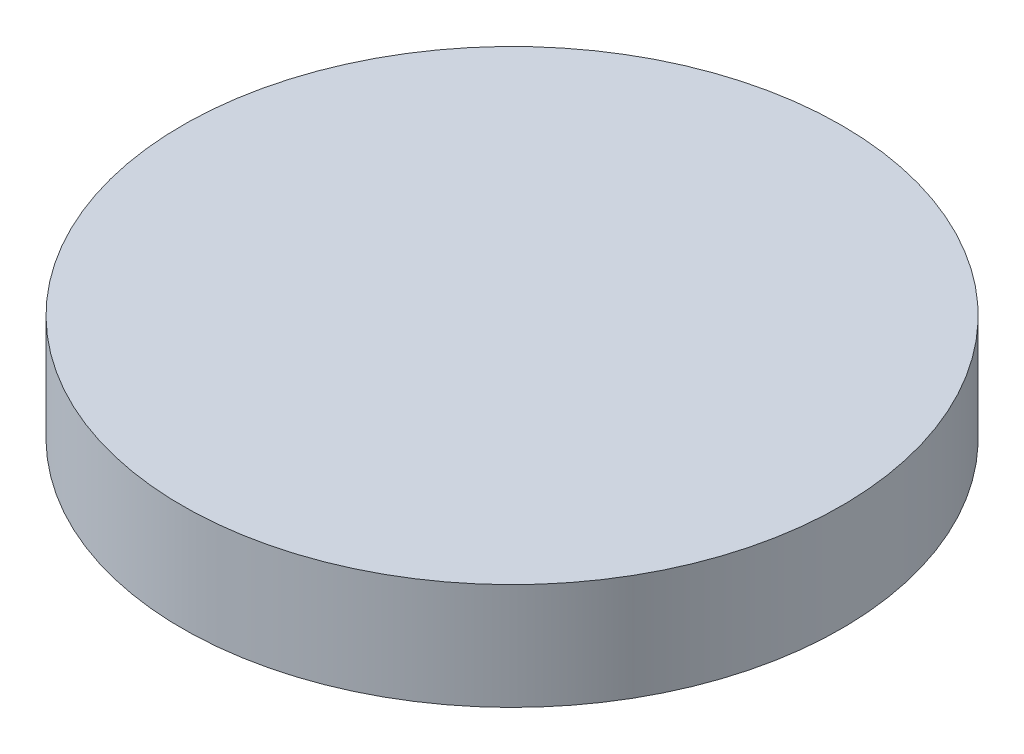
ISO-10303-21;
HEADER;
FILE_DESCRIPTION(('STEP AP214'),'2;1');
FILE_NAME('part.step','',(''),(''),'','','');
FILE_SCHEMA(('AUTOMOTIVE_DESIGN { 1 0 10303 214 1 1 1 1 }'));
ENDSEC;
DATA;
#1=APPLICATION_CONTEXT('core data for automotive mechanical design processes');
#2=APPLICATION_PROTOCOL_DEFINITION('international standard','automotive_design',2000,#1);
#3=PRODUCT_CONTEXT('',#1,'mechanical');
#4=PRODUCT('Part','Part','',(#3));
#5=PRODUCT_RELATED_PRODUCT_CATEGORY('part','',(#4));
#6=PRODUCT_DEFINITION_FORMATION('','',#4);
#7=PRODUCT_DEFINITION_CONTEXT('part definition',#1,'design');
#8=PRODUCT_DEFINITION('design','',#6,#7);
#9=PRODUCT_DEFINITION_SHAPE('','',#8);
#10=(LENGTH_UNIT() NAMED_UNIT(*) SI_UNIT(.MILLI.,.METRE.));
#11=(NAMED_UNIT(*) PLANE_ANGLE_UNIT() SI_UNIT($,.RADIAN.));
#12=(NAMED_UNIT(*) SI_UNIT($,.STERADIAN.) SOLID_ANGLE_UNIT());
#13=UNCERTAINTY_MEASURE_WITH_UNIT(LENGTH_MEASURE(1.E-05),#10,'distance_accuracy_value','');
#14=(GEOMETRIC_REPRESENTATION_CONTEXT(3) GLOBAL_UNCERTAINTY_ASSIGNED_CONTEXT((#13)) GLOBAL_UNIT_ASSIGNED_CONTEXT((#10,
#11,#12)) REPRESENTATION_CONTEXT('',''));
#15=CARTESIAN_POINT('',(0.,0.,0.));
#16=DIRECTION('',(0.,0.,1.));
#17=DIRECTION('',(1.,0.,0.));
#18=AXIS2_PLACEMENT_3D('',#15,#16,#17);
#19=CARTESIAN_POINT('',(0.,635.,0.));
#20=DIRECTION('',(0.,1.,0.));
#21=DIRECTION('',(0.,0.,1.));
#22=AXIS2_PLACEMENT_3D('',#19,#20,#21);
#23=PLANE('',#22);
#24=CARTESIAN_POINT('',(0.,635.,0.));
#25=DIRECTION('',(0.,-1.,0.));
#26=DIRECTION('',(0.,0.,-1.));
#27=AXIS2_PLACEMENT_3D('',#24,#25,#26);
#28=CIRCLE('',#27,1100.);
#29=CARTESIAN_POINT('',(0.,635.,-1100.));
#30=VERTEX_POINT('',#29);
#31=EDGE_CURVE('E12',#30,#30,#28,.T.);
#32=ORIENTED_EDGE('',*,*,#31,.F.);
#33=EDGE_LOOP('',(#32));
#34=FACE_BOUND('',#33,.T.);
#35=ADVANCED_FACE('F45',(#34),#23,.T.);
#36=CARTESIAN_POINT('',(0.,0.,0.));
#37=DIRECTION('',(0.,-1.,0.));
#38=DIRECTION('',(0.,0.,-1.));
#39=AXIS2_PLACEMENT_3D('',#36,#37,#38);
#40=CYLINDRICAL_SURFACE('',#39,1100.);
#41=ORIENTED_EDGE('',*,*,#31,.T.);
#42=EDGE_LOOP('',(#41));
#43=FACE_BOUND('',#42,.T.);
#44=CARTESIAN_POINT('',(0.,280.,0.));
#45=DIRECTION('',(0.,-1.,0.));
#46=DIRECTION('',(0.,0.,-1.));
#47=AXIS2_PLACEMENT_3D('',#44,#45,#46);
#48=CIRCLE('',#47,1100.);
#49=CARTESIAN_POINT('',(0.,280.,-1100.));
#50=VERTEX_POINT('',#49);
#51=EDGE_CURVE('E51',#50,#50,#48,.T.);
#52=ORIENTED_EDGE('',*,*,#51,.F.);
#53=EDGE_LOOP('',(#52));
#54=FACE_BOUND('',#53,.T.);
#55=ADVANCED_FACE('F66',(#43,#54),#40,.T.);
#56=CARTESIAN_POINT('',(0.,0.,0.));
#57=DIRECTION('',(0.,1.,0.));
#58=DIRECTION('',(0.,0.,1.));
#59=AXIS2_PLACEMENT_3D('',#56,#57,#58);
#60=CONICAL_SURFACE('',#59,625.,1.03815271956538);
#61=ORIENTED_EDGE('',*,*,#51,.T.);
#62=EDGE_LOOP('',(#61));
#63=FACE_BOUND('',#62,.T.);
#64=CARTESIAN_POINT('',(0.,0.,0.));
#65=DIRECTION('',(0.,-1.,0.));
#66=DIRECTION('',(0.,0.,-1.));
#67=AXIS2_PLACEMENT_3D('',#64,#65,#66);
#68=CIRCLE('',#67,625.);
#69=CARTESIAN_POINT('',(0.,0.,-625.));
#70=VERTEX_POINT('',#69);
#71=EDGE_CURVE('E55',#70,#70,#68,.T.);
#72=ORIENTED_EDGE('',*,*,#71,.F.);
#73=EDGE_LOOP('',(#72));
#74=FACE_BOUND('',#73,.T.);
#75=ADVANCED_FACE('F64',(#63,#74),#60,.T.);
#76=CARTESIAN_POINT('',(625.,0.,0.));
#77=DIRECTION('',(0.,-1.,0.));
#78=DIRECTION('',(0.,0.,-1.));
#79=AXIS2_PLACEMENT_3D('',#76,#77,#78);
#80=PLANE('',#79);
#81=ORIENTED_EDGE('',*,*,#71,.T.);
#82=EDGE_LOOP('',(#81));
#83=FACE_BOUND('',#82,.T.);
#84=ADVANCED_FACE('F62',(#83),#80,.T.);
#85=CLOSED_SHELL('',(#35,#55,#75,#84));
#86=MANIFOLD_SOLID_BREP('B2',#85);
#87=ADVANCED_BREP_SHAPE_REPRESENTATION('',(#18,#86),#14);
#88=SHAPE_DEFINITION_REPRESENTATION(#9,#87);
ENDSEC;
END-ISO-10303-21;
